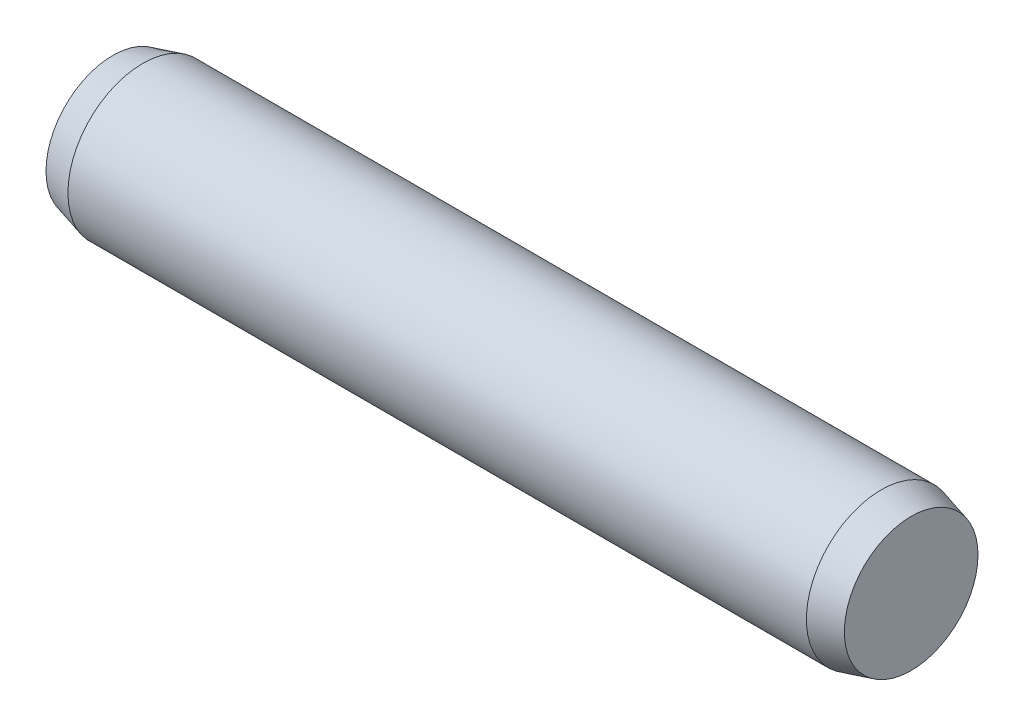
ISO-10303-21;
HEADER;
FILE_DESCRIPTION(('STEP AP214'),'2;1');
FILE_NAME('part.step','',(''),(''),'','','');
FILE_SCHEMA(('AUTOMOTIVE_DESIGN { 1 0 10303 214 1 1 1 1 }'));
ENDSEC;
DATA;
#1=APPLICATION_CONTEXT('core data for automotive mechanical design processes');
#2=APPLICATION_PROTOCOL_DEFINITION('international standard','automotive_design',2000,#1);
#3=PRODUCT_CONTEXT('',#1,'mechanical');
#4=PRODUCT('Part','Part','',(#3));
#5=PRODUCT_RELATED_PRODUCT_CATEGORY('part','',(#4));
#6=PRODUCT_DEFINITION_FORMATION('','',#4);
#7=PRODUCT_DEFINITION_CONTEXT('part definition',#1,'design');
#8=PRODUCT_DEFINITION('design','',#6,#7);
#9=PRODUCT_DEFINITION_SHAPE('','',#8);
#10=(LENGTH_UNIT() NAMED_UNIT(*) SI_UNIT(.MILLI.,.METRE.));
#11=(NAMED_UNIT(*) PLANE_ANGLE_UNIT() SI_UNIT($,.RADIAN.));
#12=(NAMED_UNIT(*) SI_UNIT($,.STERADIAN.) SOLID_ANGLE_UNIT());
#13=UNCERTAINTY_MEASURE_WITH_UNIT(LENGTH_MEASURE(1.E-05),#10,'distance_accuracy_value','');
#14=(GEOMETRIC_REPRESENTATION_CONTEXT(3) GLOBAL_UNCERTAINTY_ASSIGNED_CONTEXT((#13)) GLOBAL_UNIT_ASSIGNED_CONTEXT((#10,
#11,#12)) REPRESENTATION_CONTEXT('',''));
#15=CARTESIAN_POINT('',(0.,0.,0.));
#16=DIRECTION('',(0.,0.,1.));
#17=DIRECTION('',(1.,0.,0.));
#18=AXIS2_PLACEMENT_3D('',#15,#16,#17);
#19=CARTESIAN_POINT('',(-3.7,0.,0.));
#20=DIRECTION('',(1.,0.,0.));
#21=DIRECTION('',(0.,0.,-1.));
#22=AXIS2_PLACEMENT_3D('',#19,#20,#21);
#23=CYLINDRICAL_SURFACE('',#22,0.75);
#24=CARTESIAN_POINT('',(-3.7,0.,0.));
#25=DIRECTION('',(-1.,0.,0.));
#26=DIRECTION('',(0.,0.,1.));
#27=AXIS2_PLACEMENT_3D('',#24,#25,#26);
#28=CIRCLE('',#27,0.75);
#29=CARTESIAN_POINT('',(-3.7,0.,0.75));
#30=VERTEX_POINT('',#29);
#31=EDGE_CURVE('E46',#30,#30,#28,.T.);
#32=ORIENTED_EDGE('',*,*,#31,.F.);
#33=EDGE_LOOP('',(#32));
#34=FACE_BOUND('',#33,.T.);
#35=CARTESIAN_POINT('',(3.7,0.,0.));
#36=DIRECTION('',(1.,0.,0.));
#37=DIRECTION('',(0.,0.,-1.));
#38=AXIS2_PLACEMENT_3D('',#35,#36,#37);
#39=CIRCLE('',#38,0.75);
#40=CARTESIAN_POINT('',(3.7,0.,-0.75));
#41=VERTEX_POINT('',#40);
#42=EDGE_CURVE('E10',#41,#41,#39,.T.);
#43=ORIENTED_EDGE('',*,*,#42,.F.);
#44=EDGE_LOOP('',(#43));
#45=FACE_BOUND('',#44,.T.);
#46=ADVANCED_FACE('F32',(#34,#45),#23,.T.);
#47=CARTESIAN_POINT('',(3.7,0.,0.));
#48=DIRECTION('',(-1.,0.,0.));
#49=DIRECTION('',(0.,0.,-1.));
#50=AXIS2_PLACEMENT_3D('',#47,#48,#49);
#51=CONICAL_SURFACE('',#50,0.75,0.26179938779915);
#52=CARTESIAN_POINT('',(4.,0.,0.));
#53=DIRECTION('',(1.,0.,0.));
#54=DIRECTION('',(0.,0.,-1.));
#55=AXIS2_PLACEMENT_3D('',#52,#53,#54);
#56=CIRCLE('',#55,0.669615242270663);
#57=CARTESIAN_POINT('',(4.,0.,-0.669615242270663));
#58=VERTEX_POINT('',#57);
#59=EDGE_CURVE('E38',#58,#58,#56,.T.);
#60=ORIENTED_EDGE('',*,*,#59,.F.);
#61=EDGE_LOOP('',(#60));
#62=FACE_BOUND('',#61,.T.);
#63=ORIENTED_EDGE('',*,*,#42,.T.);
#64=EDGE_LOOP('',(#63));
#65=FACE_BOUND('',#64,.T.);
#66=ADVANCED_FACE('F56',(#62,#65),#51,.T.);
#67=CARTESIAN_POINT('',(4.,0.,0.));
#68=DIRECTION('',(1.,0.,0.));
#69=DIRECTION('',(0.,0.,-1.));
#70=AXIS2_PLACEMENT_3D('',#67,#68,#69);
#71=PLANE('',#70);
#72=ORIENTED_EDGE('',*,*,#59,.T.);
#73=EDGE_LOOP('',(#72));
#74=FACE_BOUND('',#73,.T.);
#75=ADVANCED_FACE('F60',(#74),#71,.T.);
#76=CARTESIAN_POINT('',(-3.7,0.,0.));
#77=DIRECTION('',(1.,0.,0.));
#78=DIRECTION('',(0.,0.,1.));
#79=AXIS2_PLACEMENT_3D('',#76,#77,#78);
#80=CONICAL_SURFACE('',#79,0.75,0.26179938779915);
#81=CARTESIAN_POINT('',(-4.,0.,0.));
#82=DIRECTION('',(-1.,0.,0.));
#83=DIRECTION('',(0.,0.,1.));
#84=AXIS2_PLACEMENT_3D('',#81,#82,#83);
#85=CIRCLE('',#84,0.669615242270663);
#86=CARTESIAN_POINT('',(-4.,0.,0.669615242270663));
#87=VERTEX_POINT('',#86);
#88=EDGE_CURVE('E42',#87,#87,#85,.T.);
#89=ORIENTED_EDGE('',*,*,#88,.F.);
#90=EDGE_LOOP('',(#89));
#91=FACE_BOUND('',#90,.T.);
#92=ORIENTED_EDGE('',*,*,#31,.T.);
#93=EDGE_LOOP('',(#92));
#94=FACE_BOUND('',#93,.T.);
#95=ADVANCED_FACE('F52',(#91,#94),#80,.T.);
#96=CARTESIAN_POINT('',(-4.,0.,0.));
#97=DIRECTION('',(-1.,0.,0.));
#98=DIRECTION('',(0.,0.,1.));
#99=AXIS2_PLACEMENT_3D('',#96,#97,#98);
#100=PLANE('',#99);
#101=ORIENTED_EDGE('',*,*,#88,.T.);
#102=EDGE_LOOP('',(#101));
#103=FACE_BOUND('',#102,.T.);
#104=ADVANCED_FACE('F69',(#103),#100,.T.);
#105=CLOSED_SHELL('',(#46,#66,#75,#95,#104));
#106=MANIFOLD_SOLID_BREP('B2',#105);
#107=ADVANCED_BREP_SHAPE_REPRESENTATION('',(#18,#106),#14);
#108=SHAPE_DEFINITION_REPRESENTATION(#9,#107);
ENDSEC;
END-ISO-10303-21;
